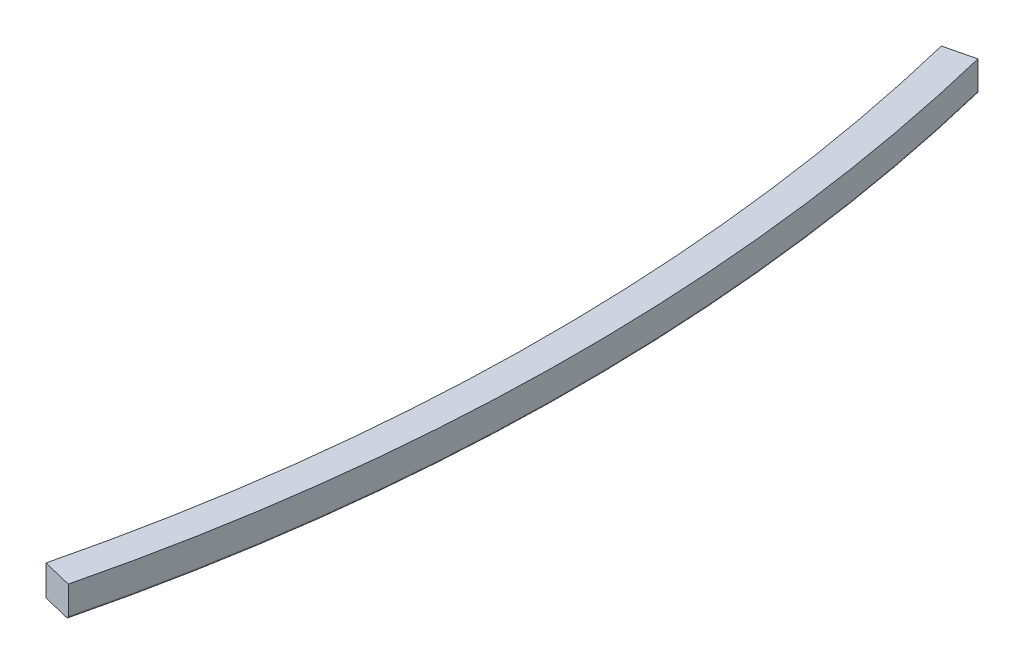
from build123d import *

# Parameters (mm, degrees)
PROFIL_W      = 40
PROFIL_H      = 40
VERRUNDUNG1_R = 3


with BuildPart() as part:
    # Austragung_GK: sweep along a path in Bahn
    with BuildLine(Plane(origin=(0, 0, 0), x_dir=(1, 0, 0), z_dir=(0, 1, 0))) as austragung_gk_path:
        ThreePointArc((-52.322891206, -600), (1.854074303, -302.171557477), (20, 0))
    # Profil → Austragung_GK (sweep)
    with BuildSketch(Plane.XY):
        Rectangle(PROFIL_W, PROFIL_H)
    sweep(path=austragung_gk_path.line)

    # Spiegeln1: part across plane


with BuildPart() as part_1:
    add(part.part)
    add(part.part.mirror(Plane.XY))

    # Verrundung1
    verrundung1_edges = [part_1.edges().sort_by_distance(p)[0] for p in [
        (20, -20, 0),
    ]]
    fillet(verrundung1_edges, radius=VERRUNDUNG1_R)


solid = part_1.part
